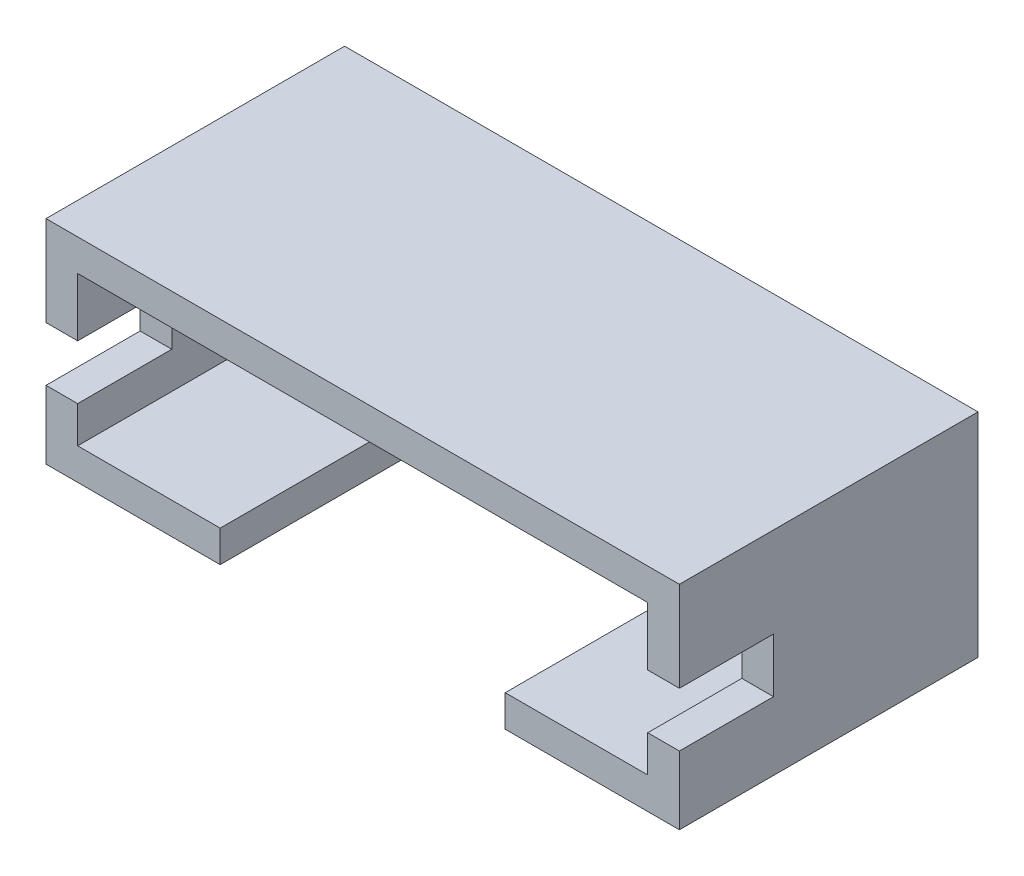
ISO-10303-21;
HEADER;
FILE_DESCRIPTION(('STEP AP214'),'2;1');
FILE_NAME('part.step','',(''),(''),'','','');
FILE_SCHEMA(('AUTOMOTIVE_DESIGN { 1 0 10303 214 1 1 1 1 }'));
ENDSEC;
DATA;
#1=APPLICATION_CONTEXT('core data for automotive mechanical design processes');
#2=APPLICATION_PROTOCOL_DEFINITION('international standard','automotive_design',2000,#1);
#3=PRODUCT_CONTEXT('',#1,'mechanical');
#4=PRODUCT('Part','Part','',(#3));
#5=PRODUCT_RELATED_PRODUCT_CATEGORY('part','',(#4));
#6=PRODUCT_DEFINITION_FORMATION('','',#4);
#7=PRODUCT_DEFINITION_CONTEXT('part definition',#1,'design');
#8=PRODUCT_DEFINITION('design','',#6,#7);
#9=PRODUCT_DEFINITION_SHAPE('','',#8);
#10=(LENGTH_UNIT() NAMED_UNIT(*) SI_UNIT(.MILLI.,.METRE.));
#11=(NAMED_UNIT(*) PLANE_ANGLE_UNIT() SI_UNIT($,.RADIAN.));
#12=(NAMED_UNIT(*) SI_UNIT($,.STERADIAN.) SOLID_ANGLE_UNIT());
#13=UNCERTAINTY_MEASURE_WITH_UNIT(LENGTH_MEASURE(1.E-05),#10,'distance_accuracy_value','');
#14=(GEOMETRIC_REPRESENTATION_CONTEXT(3) GLOBAL_UNCERTAINTY_ASSIGNED_CONTEXT((#13)) GLOBAL_UNIT_ASSIGNED_CONTEXT((#10,
#11,#12)) REPRESENTATION_CONTEXT('',''));
#15=CARTESIAN_POINT('',(0.,0.,0.));
#16=DIRECTION('',(0.,0.,1.));
#17=DIRECTION('',(1.,0.,0.));
#18=AXIS2_PLACEMENT_3D('',#15,#16,#17);
#19=CARTESIAN_POINT('',(20.2272344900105,4.7,0.));
#20=DIRECTION('',(0.,0.,-1.));
#21=DIRECTION('',(-1.,0.,0.));
#22=AXIS2_PLACEMENT_3D('',#19,#20,#21);
#23=PLANE('',#22);
#24=CARTESIAN_POINT('',(22.2351585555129,2.34999999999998,0.));
#25=DIRECTION('',(0.,0.,-1.));
#26=DIRECTION('',(-1.,0.,0.));
#27=AXIS2_PLACEMENT_3D('',#24,#25,#26);
#28=CIRCLE('',#27,0.302875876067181);
#29=CARTESIAN_POINT('',(21.9322826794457,2.34999999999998,0.));
#30=VERTEX_POINT('',#29);
#31=EDGE_CURVE('E727',#30,#30,#28,.F.);
#32=ORIENTED_EDGE('',*,*,#31,.T.);
#33=EDGE_LOOP('',(#32));
#34=FACE_BOUND('',#33,.T.);
#35=CARTESIAN_POINT('',(30.4668889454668,2.35,0.));
#36=DIRECTION('',(0.,0.,-1.));
#37=DIRECTION('',(-1.,0.,0.));
#38=AXIS2_PLACEMENT_3D('',#35,#36,#37);
#39=CIRCLE('',#38,0.302875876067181);
#40=CARTESIAN_POINT('',(30.1640130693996,2.35,0.));
#41=VERTEX_POINT('',#40);
#42=EDGE_CURVE('E744',#41,#41,#39,.F.);
#43=ORIENTED_EDGE('',*,*,#42,.T.);
#44=EDGE_LOOP('',(#43));
#45=FACE_BOUND('',#44,.T.);
#46=CARTESIAN_POINT('',(26.071966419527,2.35,0.));
#47=DIRECTION('',(0.,0.,-1.));
#48=DIRECTION('',(-1.,0.,0.));
#49=AXIS2_PLACEMENT_3D('',#46,#47,#48);
#50=CIRCLE('',#49,0.302875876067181);
#51=CARTESIAN_POINT('',(25.7690905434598,2.35,0.));
#52=VERTEX_POINT('',#51);
#53=EDGE_CURVE('E418',#52,#52,#50,.F.);
#54=ORIENTED_EDGE('',*,*,#53,.T.);
#55=EDGE_LOOP('',(#54));
#56=FACE_BOUND('',#55,.T.);
#57=DIRECTION('',(0.,-1.,0.));
#58=VECTOR('',#57,1.);
#59=CARTESIAN_POINT('',(20.2272344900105,0.,0.));
#60=LINE('',#59,#58);
#61=CARTESIAN_POINT('',(20.2272344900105,4.7,0.));
#62=VERTEX_POINT('',#61);
#63=CARTESIAN_POINT('',(20.2272344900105,0.,0.));
#64=VERTEX_POINT('',#63);
#65=EDGE_CURVE('E350',#62,#64,#60,.T.);
#66=ORIENTED_EDGE('',*,*,#65,.F.);
#67=DIRECTION('',(-1.,0.,0.));
#68=VECTOR('',#67,1.);
#69=CARTESIAN_POINT('',(20.2272344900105,4.7,0.));
#70=LINE('',#69,#68);
#71=CARTESIAN_POINT('',(34.2272344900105,4.7,0.));
#72=VERTEX_POINT('',#71);
#73=EDGE_CURVE('E383',#72,#62,#70,.T.);
#74=ORIENTED_EDGE('',*,*,#73,.F.);
#75=DIRECTION('',(0.,1.,0.));
#76=VECTOR('',#75,1.);
#77=CARTESIAN_POINT('',(34.2272344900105,0.,0.));
#78=LINE('',#77,#76);
#79=CARTESIAN_POINT('',(34.2272344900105,0.,0.));
#80=VERTEX_POINT('',#79);
#81=EDGE_CURVE('E382',#80,#72,#78,.T.);
#82=ORIENTED_EDGE('',*,*,#81,.F.);
#83=DIRECTION('',(1.,0.,0.));
#84=VECTOR('',#83,1.);
#85=CARTESIAN_POINT('',(20.2272344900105,0.,0.));
#86=LINE('',#85,#84);
#87=EDGE_CURVE('E380',#64,#80,#86,.T.);
#88=ORIENTED_EDGE('',*,*,#87,.F.);
#89=EDGE_LOOP('',(#66,#74,#82,#88));
#90=FACE_BOUND('',#89,.T.);
#91=CARTESIAN_POINT('',(28.2694276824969,2.35,0.));
#92=DIRECTION('',(0.,0.,-1.));
#93=DIRECTION('',(-1.,0.,0.));
#94=AXIS2_PLACEMENT_3D('',#91,#92,#93);
#95=CIRCLE('',#94,0.302875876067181);
#96=CARTESIAN_POINT('',(27.9665518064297,2.35,0.));
#97=VERTEX_POINT('',#96);
#98=EDGE_CURVE('E753',#97,#97,#95,.F.);
#99=ORIENTED_EDGE('',*,*,#98,.T.);
#100=EDGE_LOOP('',(#99));
#101=FACE_BOUND('',#100,.T.);
#102=CARTESIAN_POINT('',(24.269361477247,2.35,0.));
#103=DIRECTION('',(0.,0.,-1.));
#104=DIRECTION('',(-1.,0.,0.));
#105=AXIS2_PLACEMENT_3D('',#102,#103,#104);
#106=CIRCLE('',#105,0.302875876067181);
#107=CARTESIAN_POINT('',(23.9664856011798,2.35,0.));
#108=VERTEX_POINT('',#107);
#109=EDGE_CURVE('E735',#108,#108,#106,.F.);
#110=ORIENTED_EDGE('',*,*,#109,.T.);
#111=EDGE_LOOP('',(#110));
#112=FACE_BOUND('',#111,.T.);
#113=CARTESIAN_POINT('',(32.2351585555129,2.35,0.));
#114=DIRECTION('',(0.,0.,-1.));
#115=DIRECTION('',(-1.,0.,0.));
#116=AXIS2_PLACEMENT_3D('',#113,#114,#115);
#117=CIRCLE('',#116,0.302875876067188);
#118=CARTESIAN_POINT('',(31.9322826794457,2.35,0.));
#119=VERTEX_POINT('',#118);
#120=EDGE_CURVE('E716',#119,#119,#117,.F.);
#121=ORIENTED_EDGE('',*,*,#120,.T.);
#122=EDGE_LOOP('',(#121));
#123=FACE_BOUND('',#122,.T.);
#124=ADVANCED_FACE('F31',(#34,#45,#56,#90,#101,#112,#123),#23,.T.);
#125=CARTESIAN_POINT('',(20.2272344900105,4.7,0.7));
#126=DIRECTION('',(0.,0.,-1.));
#127=DIRECTION('',(-1.,0.,0.));
#128=AXIS2_PLACEMENT_3D('',#125,#126,#127);
#129=PLANE('',#128);
#130=CARTESIAN_POINT('',(22.2351585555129,2.34999999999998,0.7));
#131=DIRECTION('',(0.,0.,-1.));
#132=DIRECTION('',(-1.,0.,0.));
#133=AXIS2_PLACEMENT_3D('',#130,#131,#132);
#134=CIRCLE('',#133,0.302875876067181);
#135=CARTESIAN_POINT('',(21.9322826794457,2.34999999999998,0.7));
#136=VERTEX_POINT('',#135);
#137=EDGE_CURVE('E39',#136,#136,#134,.F.);
#138=ORIENTED_EDGE('',*,*,#137,.F.);
#139=EDGE_LOOP('',(#138));
#140=FACE_BOUND('',#139,.T.);
#141=CARTESIAN_POINT('',(30.4668889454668,2.35,0.7));
#142=DIRECTION('',(0.,0.,-1.));
#143=DIRECTION('',(-1.,0.,0.));
#144=AXIS2_PLACEMENT_3D('',#141,#142,#143);
#145=CIRCLE('',#144,0.302875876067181);
#146=CARTESIAN_POINT('',(30.1640130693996,2.35,0.7));
#147=VERTEX_POINT('',#146);
#148=EDGE_CURVE('E231',#147,#147,#145,.F.);
#149=ORIENTED_EDGE('',*,*,#148,.F.);
#150=EDGE_LOOP('',(#149));
#151=FACE_BOUND('',#150,.T.);
#152=CARTESIAN_POINT('',(26.071966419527,2.35,0.7));
#153=DIRECTION('',(0.,0.,-1.));
#154=DIRECTION('',(-1.,0.,0.));
#155=AXIS2_PLACEMENT_3D('',#152,#153,#154);
#156=CIRCLE('',#155,0.302875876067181);
#157=CARTESIAN_POINT('',(25.7690905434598,2.35,0.7));
#158=VERTEX_POINT('',#157);
#159=EDGE_CURVE('E225',#158,#158,#156,.F.);
#160=ORIENTED_EDGE('',*,*,#159,.F.);
#161=EDGE_LOOP('',(#160));
#162=FACE_BOUND('',#161,.T.);
#163=DIRECTION('',(0.,-1.,0.));
#164=VECTOR('',#163,1.);
#165=CARTESIAN_POINT('',(20.9272344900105,4.7,0.7));
#166=LINE('',#165,#164);
#167=CARTESIAN_POINT('',(20.9272344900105,4.,0.7));
#168=VERTEX_POINT('',#167);
#169=CARTESIAN_POINT('',(20.9272344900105,0.699999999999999,0.7));
#170=VERTEX_POINT('',#169);
#171=EDGE_CURVE('E252',#168,#170,#166,.T.);
#172=ORIENTED_EDGE('',*,*,#171,.T.);
#173=DIRECTION('',(1.,0.,0.));
#174=VECTOR('',#173,1.);
#175=CARTESIAN_POINT('',(20.2272344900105,0.699999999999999,0.7));
#176=LINE('',#175,#174);
#177=CARTESIAN_POINT('',(33.5272344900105,0.7,0.7));
#178=VERTEX_POINT('',#177);
#179=EDGE_CURVE('E346',#170,#178,#176,.T.);
#180=ORIENTED_EDGE('',*,*,#179,.T.);
#181=DIRECTION('',(0.,1.,0.));
#182=VECTOR('',#181,1.);
#183=CARTESIAN_POINT('',(33.5272344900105,4.7,0.7));
#184=LINE('',#183,#182);
#185=CARTESIAN_POINT('',(33.5272344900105,4.,0.7));
#186=VERTEX_POINT('',#185);
#187=EDGE_CURVE('E358',#178,#186,#184,.T.);
#188=ORIENTED_EDGE('',*,*,#187,.T.);
#189=DIRECTION('',(-1.,0.,0.));
#190=VECTOR('',#189,1.);
#191=CARTESIAN_POINT('',(20.2272344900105,4.,0.7));
#192=LINE('',#191,#190);
#193=EDGE_CURVE('E362',#186,#168,#192,.T.);
#194=ORIENTED_EDGE('',*,*,#193,.T.);
#195=EDGE_LOOP('',(#172,#180,#188,#194));
#196=FACE_BOUND('',#195,.T.);
#197=CARTESIAN_POINT('',(28.2694276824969,2.35,0.7));
#198=DIRECTION('',(0.,0.,-1.));
#199=DIRECTION('',(-1.,0.,0.));
#200=AXIS2_PLACEMENT_3D('',#197,#198,#199);
#201=CIRCLE('',#200,0.302875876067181);
#202=CARTESIAN_POINT('',(27.9665518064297,2.35,0.7));
#203=VERTEX_POINT('',#202);
#204=EDGE_CURVE('E228',#203,#203,#201,.F.);
#205=ORIENTED_EDGE('',*,*,#204,.F.);
#206=EDGE_LOOP('',(#205));
#207=FACE_BOUND('',#206,.T.);
#208=CARTESIAN_POINT('',(24.269361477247,2.35,0.7));
#209=DIRECTION('',(0.,0.,-1.));
#210=DIRECTION('',(-1.,0.,0.));
#211=AXIS2_PLACEMENT_3D('',#208,#209,#210);
#212=CIRCLE('',#211,0.302875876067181);
#213=CARTESIAN_POINT('',(23.9664856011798,2.35,0.7));
#214=VERTEX_POINT('',#213);
#215=EDGE_CURVE('E234',#214,#214,#212,.F.);
#216=ORIENTED_EDGE('',*,*,#215,.F.);
#217=EDGE_LOOP('',(#216));
#218=FACE_BOUND('',#217,.T.);
#219=CARTESIAN_POINT('',(32.2351585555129,2.35,0.7));
#220=DIRECTION('',(0.,0.,-1.));
#221=DIRECTION('',(-1.,0.,0.));
#222=AXIS2_PLACEMENT_3D('',#219,#220,#221);
#223=CIRCLE('',#222,0.302875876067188);
#224=CARTESIAN_POINT('',(31.9322826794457,2.35,0.7));
#225=VERTEX_POINT('',#224);
#226=EDGE_CURVE('E11',#225,#225,#223,.F.);
#227=ORIENTED_EDGE('',*,*,#226,.F.);
#228=EDGE_LOOP('',(#227));
#229=FACE_BOUND('',#228,.T.);
#230=ADVANCED_FACE('F241',(#140,#151,#162,#196,#207,#218,#229),#129,.F.);
#231=CARTESIAN_POINT('',(20.2272344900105,4.7,6.6));
#232=DIRECTION('',(0.,0.,-1.));
#233=DIRECTION('',(-1.,0.,0.));
#234=AXIS2_PLACEMENT_3D('',#231,#232,#233);
#235=PLANE('',#234);
#236=DIRECTION('',(1.,0.,0.));
#237=VECTOR('',#236,1.);
#238=CARTESIAN_POINT('',(20.2272344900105,0.,6.6));
#239=LINE('',#238,#237);
#240=CARTESIAN_POINT('',(20.2272344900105,0.,6.6));
#241=VERTEX_POINT('',#240);
#242=CARTESIAN_POINT('',(24.0772344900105,0.,6.6));
#243=VERTEX_POINT('',#242);
#244=EDGE_CURVE('E187',#241,#243,#239,.T.);
#245=ORIENTED_EDGE('',*,*,#244,.T.);
#246=DIRECTION('',(0.,-1.,0.));
#247=VECTOR('',#246,1.);
#248=CARTESIAN_POINT('',(24.0772344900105,4.701,6.6));
#249=LINE('',#248,#247);
#250=CARTESIAN_POINT('',(24.0772344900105,0.699999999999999,6.6));
#251=VERTEX_POINT('',#250);
#252=EDGE_CURVE('E168',#251,#243,#249,.T.);
#253=ORIENTED_EDGE('',*,*,#252,.F.);
#254=DIRECTION('',(1.,0.,0.));
#255=VECTOR('',#254,1.);
#256=CARTESIAN_POINT('',(20.2272344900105,0.699999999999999,6.6));
#257=LINE('',#256,#255);
#258=CARTESIAN_POINT('',(20.9272344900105,0.699999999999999,6.6));
#259=VERTEX_POINT('',#258);
#260=EDGE_CURVE('E371',#259,#251,#257,.T.);
#261=ORIENTED_EDGE('',*,*,#260,.F.);
#262=DIRECTION('',(0.,-1.,0.));
#263=VECTOR('',#262,1.);
#264=CARTESIAN_POINT('',(20.9272344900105,4.7,6.6));
#265=LINE('',#264,#263);
#266=CARTESIAN_POINT('',(20.9272344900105,1.50856992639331,6.6));
#267=VERTEX_POINT('',#266);
#268=EDGE_CURVE('E366',#267,#259,#265,.T.);
#269=ORIENTED_EDGE('',*,*,#268,.F.);
#270=DIRECTION('',(1.,0.,0.));
#271=VECTOR('',#270,1.);
#272=CARTESIAN_POINT('',(20.2272344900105,1.50856992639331,6.6));
#273=LINE('',#272,#271);
#274=CARTESIAN_POINT('',(20.2272344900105,1.50856992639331,6.6));
#275=VERTEX_POINT('',#274);
#276=EDGE_CURVE('E54',#275,#267,#273,.T.);
#277=ORIENTED_EDGE('',*,*,#276,.F.);
#278=DIRECTION('',(0.,-1.,0.));
#279=VECTOR('',#278,1.);
#280=CARTESIAN_POINT('',(20.2272344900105,0.,6.6));
#281=LINE('',#280,#279);
#282=EDGE_CURVE('E194',#275,#241,#281,.T.);
#283=ORIENTED_EDGE('',*,*,#282,.T.);
#284=EDGE_LOOP('',(#245,#253,#261,#269,#277,#283));
#285=FACE_BOUND('',#284,.T.);
#286=ADVANCED_FACE('F192',(#285),#235,.F.);
#287=CARTESIAN_POINT('',(20.2272344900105,4.7,6.6));
#288=VERTEX_POINT('',#287);
#289=CARTESIAN_POINT('',(20.2272344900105,2.70856992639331,6.6));
#290=VERTEX_POINT('',#289);
#291=EDGE_CURVE('E200',#288,#290,#281,.T.);
#292=ORIENTED_EDGE('',*,*,#291,.T.);
#293=DIRECTION('',(1.,0.,0.));
#294=VECTOR('',#293,1.);
#295=CARTESIAN_POINT('',(20.2272344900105,2.70856992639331,6.6));
#296=LINE('',#295,#294);
#297=CARTESIAN_POINT('',(20.9272344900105,2.70856992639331,6.6));
#298=VERTEX_POINT('',#297);
#299=EDGE_CURVE('E327',#290,#298,#296,.T.);
#300=ORIENTED_EDGE('',*,*,#299,.T.);
#301=CARTESIAN_POINT('',(20.9272344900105,4.,6.6));
#302=VERTEX_POINT('',#301);
#303=EDGE_CURVE('E367',#302,#298,#265,.T.);
#304=ORIENTED_EDGE('',*,*,#303,.F.);
#305=DIRECTION('',(-1.,0.,0.));
#306=VECTOR('',#305,1.);
#307=CARTESIAN_POINT('',(20.2272344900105,4.,6.6));
#308=LINE('',#307,#306);
#309=CARTESIAN_POINT('',(33.5272344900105,4.,6.6));
#310=VERTEX_POINT('',#309);
#311=EDGE_CURVE('E356',#310,#302,#308,.T.);
#312=ORIENTED_EDGE('',*,*,#311,.F.);
#313=DIRECTION('',(0.,1.,0.));
#314=VECTOR('',#313,1.);
#315=CARTESIAN_POINT('',(33.5272344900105,4.7,6.6));
#316=LINE('',#315,#314);
#317=CARTESIAN_POINT('',(33.5272344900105,2.70856992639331,6.6));
#318=VERTEX_POINT('',#317);
#319=EDGE_CURVE('E373',#318,#310,#316,.T.);
#320=ORIENTED_EDGE('',*,*,#319,.F.);
#321=CARTESIAN_POINT('',(34.2272344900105,2.70856992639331,6.6));
#322=VERTEX_POINT('',#321);
#323=EDGE_CURVE('E331',#318,#322,#296,.T.);
#324=ORIENTED_EDGE('',*,*,#323,.T.);
#325=DIRECTION('',(0.,1.,0.));
#326=VECTOR('',#325,1.);
#327=CARTESIAN_POINT('',(34.2272344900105,0.,6.6));
#328=LINE('',#327,#326);
#329=CARTESIAN_POINT('',(34.2272344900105,4.7,6.6));
#330=VERTEX_POINT('',#329);
#331=EDGE_CURVE('E195',#322,#330,#328,.T.);
#332=ORIENTED_EDGE('',*,*,#331,.T.);
#333=DIRECTION('',(-1.,0.,0.));
#334=VECTOR('',#333,1.);
#335=CARTESIAN_POINT('',(20.2272344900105,4.7,6.6));
#336=LINE('',#335,#334);
#337=EDGE_CURVE('E205',#330,#288,#336,.T.);
#338=ORIENTED_EDGE('',*,*,#337,.T.);
#339=EDGE_LOOP('',(#292,#300,#304,#312,#320,#324,#332,#338));
#340=FACE_BOUND('',#339,.T.);
#341=ADVANCED_FACE('F289',(#340),#235,.F.);
#342=CARTESIAN_POINT('',(30.3772344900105,0.7,6.6));
#343=VERTEX_POINT('',#342);
#344=CARTESIAN_POINT('',(33.5272344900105,0.7,6.6));
#345=VERTEX_POINT('',#344);
#346=EDGE_CURVE('E370',#343,#345,#257,.T.);
#347=ORIENTED_EDGE('',*,*,#346,.F.);
#348=DIRECTION('',(0.,-1.,0.));
#349=VECTOR('',#348,1.);
#350=CARTESIAN_POINT('',(30.3772344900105,4.701,6.6));
#351=LINE('',#350,#349);
#352=CARTESIAN_POINT('',(30.3772344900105,0.,6.6));
#353=VERTEX_POINT('',#352);
#354=EDGE_CURVE('E406',#343,#353,#351,.T.);
#355=ORIENTED_EDGE('',*,*,#354,.T.);
#356=CARTESIAN_POINT('',(34.2272344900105,0.,6.6));
#357=VERTEX_POINT('',#356);
#358=EDGE_CURVE('E196',#353,#357,#239,.T.);
#359=ORIENTED_EDGE('',*,*,#358,.T.);
#360=CARTESIAN_POINT('',(34.2272344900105,1.50856992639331,6.6));
#361=VERTEX_POINT('',#360);
#362=EDGE_CURVE('E198',#357,#361,#328,.T.);
#363=ORIENTED_EDGE('',*,*,#362,.T.);
#364=CARTESIAN_POINT('',(33.5272344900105,1.50856992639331,6.6));
#365=VERTEX_POINT('',#364);
#366=EDGE_CURVE('E321',#365,#361,#273,.T.);
#367=ORIENTED_EDGE('',*,*,#366,.F.);
#368=EDGE_CURVE('E374',#345,#365,#316,.T.);
#369=ORIENTED_EDGE('',*,*,#368,.F.);
#370=EDGE_LOOP('',(#347,#355,#359,#363,#367,#369));
#371=FACE_BOUND('',#370,.T.);
#372=ADVANCED_FACE('F286',(#371),#235,.F.);
#373=CARTESIAN_POINT('',(20.2272344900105,0.,6.6));
#374=DIRECTION('',(1.,0.,0.));
#375=DIRECTION('',(0.,0.,-1.));
#376=AXIS2_PLACEMENT_3D('',#373,#374,#375);
#377=PLANE('',#376);
#378=DIRECTION('',(0.,1.,0.));
#379=VECTOR('',#378,1.);
#380=CARTESIAN_POINT('',(20.2272344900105,1.50856992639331,4.52038481));
#381=LINE('',#380,#379);
#382=CARTESIAN_POINT('',(20.2272344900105,1.50856992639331,4.52038481));
#383=VERTEX_POINT('',#382);
#384=CARTESIAN_POINT('',(20.2272344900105,2.70856992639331,4.52038481));
#385=VERTEX_POINT('',#384);
#386=EDGE_CURVE('E312',#383,#385,#381,.T.);
#387=ORIENTED_EDGE('',*,*,#386,.T.);
#388=DIRECTION('',(0.,0.,1.));
#389=VECTOR('',#388,1.);
#390=CARTESIAN_POINT('',(20.2272344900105,2.70856992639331,6.6));
#391=LINE('',#390,#389);
#392=EDGE_CURVE('E315',#385,#290,#391,.T.);
#393=ORIENTED_EDGE('',*,*,#392,.T.);
#394=ORIENTED_EDGE('',*,*,#291,.F.);
#395=DIRECTION('',(0.,0.,-1.));
#396=VECTOR('',#395,1.);
#397=CARTESIAN_POINT('',(20.2272344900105,4.7,6.6));
#398=LINE('',#397,#396);
#399=EDGE_CURVE('E207',#288,#62,#398,.T.);
#400=ORIENTED_EDGE('',*,*,#399,.T.);
#401=ORIENTED_EDGE('',*,*,#65,.T.);
#402=DIRECTION('',(0.,0.,-1.));
#403=VECTOR('',#402,1.);
#404=CARTESIAN_POINT('',(20.2272344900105,0.,6.6));
#405=LINE('',#404,#403);
#406=EDGE_CURVE('E216',#241,#64,#405,.T.);
#407=ORIENTED_EDGE('',*,*,#406,.F.);
#408=ORIENTED_EDGE('',*,*,#282,.F.);
#409=DIRECTION('',(0.,0.,-1.));
#410=VECTOR('',#409,1.);
#411=CARTESIAN_POINT('',(20.2272344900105,1.50856992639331,6.6));
#412=LINE('',#411,#410);
#413=EDGE_CURVE('E317',#275,#383,#412,.T.);
#414=ORIENTED_EDGE('',*,*,#413,.T.);
#415=EDGE_LOOP('',(#387,#393,#394,#400,#401,#407,#408,#414));
#416=FACE_BOUND('',#415,.T.);
#417=ADVANCED_FACE('F33',(#416),#377,.F.);
#418=CARTESIAN_POINT('',(20.2272344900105,0.,6.6));
#419=DIRECTION('',(0.,1.,0.));
#420=DIRECTION('',(-1.,0.,0.));
#421=AXIS2_PLACEMENT_3D('',#418,#419,#420);
#422=PLANE('',#421);
#423=DIRECTION('',(1.,0.,0.));
#424=VECTOR('',#423,1.);
#425=CARTESIAN_POINT('',(24.0772344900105,0.,1.16189975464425));
#426=LINE('',#425,#424);
#427=CARTESIAN_POINT('',(24.0772344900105,0.,1.16189975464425));
#428=VERTEX_POINT('',#427);
#429=CARTESIAN_POINT('',(30.3772344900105,0.,1.16189975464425));
#430=VERTEX_POINT('',#429);
#431=EDGE_CURVE('E190',#428,#430,#426,.T.);
#432=ORIENTED_EDGE('',*,*,#431,.F.);
#433=DIRECTION('',(0.,0.,-1.));
#434=VECTOR('',#433,1.);
#435=CARTESIAN_POINT('',(24.0772344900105,0.,6.6));
#436=LINE('',#435,#434);
#437=EDGE_CURVE('E172',#243,#428,#436,.T.);
#438=ORIENTED_EDGE('',*,*,#437,.F.);
#439=ORIENTED_EDGE('',*,*,#244,.F.);
#440=ORIENTED_EDGE('',*,*,#406,.T.);
#441=ORIENTED_EDGE('',*,*,#87,.T.);
#442=DIRECTION('',(0.,0.,-1.));
#443=VECTOR('',#442,1.);
#444=CARTESIAN_POINT('',(34.2272344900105,0.,6.6));
#445=LINE('',#444,#443);
#446=EDGE_CURVE('E213',#357,#80,#445,.T.);
#447=ORIENTED_EDGE('',*,*,#446,.F.);
#448=ORIENTED_EDGE('',*,*,#358,.F.);
#449=DIRECTION('',(0.,0.,1.));
#450=VECTOR('',#449,1.);
#451=CARTESIAN_POINT('',(30.3772344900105,0.,6.6));
#452=LINE('',#451,#450);
#453=EDGE_CURVE('E407',#430,#353,#452,.T.);
#454=ORIENTED_EDGE('',*,*,#453,.F.);
#455=EDGE_LOOP('',(#432,#438,#439,#440,#441,#447,#448,#454));
#456=FACE_BOUND('',#455,.T.);
#457=ADVANCED_FACE('F185',(#456),#422,.F.);
#458=CARTESIAN_POINT('',(34.2272344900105,0.,6.6));
#459=DIRECTION('',(-1.,0.,0.));
#460=DIRECTION('',(0.,0.,1.));
#461=AXIS2_PLACEMENT_3D('',#458,#459,#460);
#462=PLANE('',#461);
#463=ORIENTED_EDGE('',*,*,#331,.F.);
#464=DIRECTION('',(0.,0.,1.));
#465=VECTOR('',#464,1.);
#466=CARTESIAN_POINT('',(34.2272344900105,2.70856992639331,6.6));
#467=LINE('',#466,#465);
#468=CARTESIAN_POINT('',(34.2272344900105,2.70856992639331,4.52038481));
#469=VERTEX_POINT('',#468);
#470=EDGE_CURVE('E323',#469,#322,#467,.T.);
#471=ORIENTED_EDGE('',*,*,#470,.F.);
#472=DIRECTION('',(0.,1.,0.));
#473=VECTOR('',#472,1.);
#474=CARTESIAN_POINT('',(34.2272344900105,1.50856992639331,4.52038481));
#475=LINE('',#474,#473);
#476=CARTESIAN_POINT('',(34.2272344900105,1.50856992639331,4.52038481));
#477=VERTEX_POINT('',#476);
#478=EDGE_CURVE('E410',#477,#469,#475,.T.);
#479=ORIENTED_EDGE('',*,*,#478,.F.);
#480=DIRECTION('',(0.,0.,-1.));
#481=VECTOR('',#480,1.);
#482=CARTESIAN_POINT('',(34.2272344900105,1.50856992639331,6.6));
#483=LINE('',#482,#481);
#484=EDGE_CURVE('E401',#361,#477,#483,.T.);
#485=ORIENTED_EDGE('',*,*,#484,.F.);
#486=ORIENTED_EDGE('',*,*,#362,.F.);
#487=ORIENTED_EDGE('',*,*,#446,.T.);
#488=ORIENTED_EDGE('',*,*,#81,.T.);
#489=DIRECTION('',(0.,0.,-1.));
#490=VECTOR('',#489,1.);
#491=CARTESIAN_POINT('',(34.2272344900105,4.7,6.6));
#492=LINE('',#491,#490);
#493=EDGE_CURVE('E210',#330,#72,#492,.T.);
#494=ORIENTED_EDGE('',*,*,#493,.F.);
#495=EDGE_LOOP('',(#463,#471,#479,#485,#486,#487,#488,#494));
#496=FACE_BOUND('',#495,.T.);
#497=ADVANCED_FACE('F295',(#496),#462,.F.);
#498=CARTESIAN_POINT('',(20.2272344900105,4.7,6.6));
#499=DIRECTION('',(0.,-1.,0.));
#500=DIRECTION('',(0.,0.,-1.));
#501=AXIS2_PLACEMENT_3D('',#498,#499,#500);
#502=PLANE('',#501);
#503=ORIENTED_EDGE('',*,*,#73,.T.);
#504=ORIENTED_EDGE('',*,*,#399,.F.);
#505=ORIENTED_EDGE('',*,*,#337,.F.);
#506=ORIENTED_EDGE('',*,*,#493,.T.);
#507=EDGE_LOOP('',(#503,#504,#505,#506));
#508=FACE_BOUND('',#507,.T.);
#509=ADVANCED_FACE('F291',(#508),#502,.F.);
#510=CARTESIAN_POINT('',(20.9272344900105,0.,6.6));
#511=DIRECTION('',(1.,0.,0.));
#512=DIRECTION('',(0.,0.,-1.));
#513=AXIS2_PLACEMENT_3D('',#510,#511,#512);
#514=PLANE('',#513);
#515=DIRECTION('',(0.,0.,1.));
#516=VECTOR('',#515,1.);
#517=CARTESIAN_POINT('',(20.9272344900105,2.70856992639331,6.6));
#518=LINE('',#517,#516);
#519=CARTESIAN_POINT('',(20.9272344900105,2.70856992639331,4.52038481));
#520=VERTEX_POINT('',#519);
#521=EDGE_CURVE('E343',#520,#298,#518,.T.);
#522=ORIENTED_EDGE('',*,*,#521,.F.);
#523=DIRECTION('',(0.,1.,0.));
#524=VECTOR('',#523,1.);
#525=CARTESIAN_POINT('',(20.9272344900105,0.,4.52038481));
#526=LINE('',#525,#524);
#527=CARTESIAN_POINT('',(20.9272344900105,1.50856992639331,4.52038481));
#528=VERTEX_POINT('',#527);
#529=EDGE_CURVE('E341',#528,#520,#526,.T.);
#530=ORIENTED_EDGE('',*,*,#529,.F.);
#531=DIRECTION('',(0.,0.,-1.));
#532=VECTOR('',#531,1.);
#533=CARTESIAN_POINT('',(20.9272344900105,1.50856992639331,6.6));
#534=LINE('',#533,#532);
#535=EDGE_CURVE('E330',#267,#528,#534,.T.);
#536=ORIENTED_EDGE('',*,*,#535,.F.);
#537=ORIENTED_EDGE('',*,*,#268,.T.);
#538=DIRECTION('',(0.,0.,-1.));
#539=VECTOR('',#538,1.);
#540=CARTESIAN_POINT('',(20.9272344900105,0.699999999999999,6.6));
#541=LINE('',#540,#539);
#542=EDGE_CURVE('E347',#259,#170,#541,.T.);
#543=ORIENTED_EDGE('',*,*,#542,.T.);
#544=ORIENTED_EDGE('',*,*,#171,.F.);
#545=DIRECTION('',(0.,0.,-1.));
#546=VECTOR('',#545,1.);
#547=CARTESIAN_POINT('',(20.9272344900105,4.,6.6));
#548=LINE('',#547,#546);
#549=EDGE_CURVE('E352',#302,#168,#548,.T.);
#550=ORIENTED_EDGE('',*,*,#549,.F.);
#551=ORIENTED_EDGE('',*,*,#303,.T.);
#552=EDGE_LOOP('',(#522,#530,#536,#537,#543,#544,#550,#551));
#553=FACE_BOUND('',#552,.T.);
#554=ADVANCED_FACE('F294',(#553),#514,.T.);
#555=CARTESIAN_POINT('',(20.2272344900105,0.699999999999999,6.6));
#556=DIRECTION('',(0.,1.,0.));
#557=DIRECTION('',(-1.,0.,0.));
#558=AXIS2_PLACEMENT_3D('',#555,#556,#557);
#559=PLANE('',#558);
#560=DIRECTION('',(0.,0.,-1.));
#561=VECTOR('',#560,1.);
#562=CARTESIAN_POINT('',(24.0772344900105,0.699999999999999,6.6));
#563=LINE('',#562,#561);
#564=CARTESIAN_POINT('',(24.0772344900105,0.699999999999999,1.16189975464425));
#565=VERTEX_POINT('',#564);
#566=EDGE_CURVE('E175',#251,#565,#563,.T.);
#567=ORIENTED_EDGE('',*,*,#566,.T.);
#568=DIRECTION('',(1.,0.,0.));
#569=VECTOR('',#568,1.);
#570=CARTESIAN_POINT('',(24.0772344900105,0.699999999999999,1.16189975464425));
#571=LINE('',#570,#569);
#572=CARTESIAN_POINT('',(30.3772344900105,0.7,1.16189975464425));
#573=VERTEX_POINT('',#572);
#574=EDGE_CURVE('E414',#565,#573,#571,.T.);
#575=ORIENTED_EDGE('',*,*,#574,.T.);
#576=DIRECTION('',(0.,0.,1.));
#577=VECTOR('',#576,1.);
#578=CARTESIAN_POINT('',(30.3772344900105,0.7,6.6));
#579=LINE('',#578,#577);
#580=EDGE_CURVE('E180',#573,#343,#579,.T.);
#581=ORIENTED_EDGE('',*,*,#580,.T.);
#582=ORIENTED_EDGE('',*,*,#346,.T.);
#583=DIRECTION('',(0.,0.,-1.));
#584=VECTOR('',#583,1.);
#585=CARTESIAN_POINT('',(33.5272344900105,0.7,6.6));
#586=LINE('',#585,#584);
#587=EDGE_CURVE('E351',#345,#178,#586,.T.);
#588=ORIENTED_EDGE('',*,*,#587,.T.);
#589=ORIENTED_EDGE('',*,*,#179,.F.);
#590=ORIENTED_EDGE('',*,*,#542,.F.);
#591=ORIENTED_EDGE('',*,*,#260,.T.);
#592=EDGE_LOOP('',(#567,#575,#581,#582,#588,#589,#590,#591));
#593=FACE_BOUND('',#592,.T.);
#594=ADVANCED_FACE('F445',(#593),#559,.T.);
#595=CARTESIAN_POINT('',(33.5272344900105,0.,6.6));
#596=DIRECTION('',(-1.,0.,0.));
#597=DIRECTION('',(0.,0.,1.));
#598=AXIS2_PLACEMENT_3D('',#595,#596,#597);
#599=PLANE('',#598);
#600=DIRECTION('',(0.,0.,-1.));
#601=VECTOR('',#600,1.);
#602=CARTESIAN_POINT('',(33.5272344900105,2.70856992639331,6.6));
#603=LINE('',#602,#601);
#604=CARTESIAN_POINT('',(33.5272344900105,2.70856992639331,4.52038481));
#605=VERTEX_POINT('',#604);
#606=EDGE_CURVE('E223',#318,#605,#603,.T.);
#607=ORIENTED_EDGE('',*,*,#606,.F.);
#608=ORIENTED_EDGE('',*,*,#319,.T.);
#609=DIRECTION('',(0.,0.,-1.));
#610=VECTOR('',#609,1.);
#611=CARTESIAN_POINT('',(33.5272344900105,4.,6.6));
#612=LINE('',#611,#610);
#613=EDGE_CURVE('E355',#310,#186,#612,.T.);
#614=ORIENTED_EDGE('',*,*,#613,.T.);
#615=ORIENTED_EDGE('',*,*,#187,.F.);
#616=ORIENTED_EDGE('',*,*,#587,.F.);
#617=ORIENTED_EDGE('',*,*,#368,.T.);
#618=DIRECTION('',(0.,0.,1.));
#619=VECTOR('',#618,1.);
#620=CARTESIAN_POINT('',(33.5272344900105,1.50856992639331,6.6));
#621=LINE('',#620,#619);
#622=CARTESIAN_POINT('',(33.5272344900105,1.50856992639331,4.52038481));
#623=VERTEX_POINT('',#622);
#624=EDGE_CURVE('E218',#623,#365,#621,.T.);
#625=ORIENTED_EDGE('',*,*,#624,.F.);
#626=DIRECTION('',(0.,-1.,0.));
#627=VECTOR('',#626,1.);
#628=CARTESIAN_POINT('',(33.5272344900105,0.,4.52038481));
#629=LINE('',#628,#627);
#630=EDGE_CURVE('E220',#605,#623,#629,.T.);
#631=ORIENTED_EDGE('',*,*,#630,.F.);
#632=EDGE_LOOP('',(#607,#608,#614,#615,#616,#617,#625,#631));
#633=FACE_BOUND('',#632,.T.);
#634=ADVANCED_FACE('F435',(#633),#599,.T.);
#635=CARTESIAN_POINT('',(20.2272344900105,4.,6.6));
#636=DIRECTION('',(0.,-1.,0.));
#637=DIRECTION('',(0.,0.,-1.));
#638=AXIS2_PLACEMENT_3D('',#635,#636,#637);
#639=PLANE('',#638);
#640=ORIENTED_EDGE('',*,*,#193,.F.);
#641=ORIENTED_EDGE('',*,*,#613,.F.);
#642=ORIENTED_EDGE('',*,*,#311,.T.);
#643=ORIENTED_EDGE('',*,*,#549,.T.);
#644=EDGE_LOOP('',(#640,#641,#642,#643));
#645=FACE_BOUND('',#644,.T.);
#646=ADVANCED_FACE('F440',(#645),#639,.T.);
#647=CARTESIAN_POINT('',(20.2272344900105,1.50856992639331,6.6));
#648=DIRECTION('',(0.,-1.,0.));
#649=DIRECTION('',(0.,0.,-1.));
#650=AXIS2_PLACEMENT_3D('',#647,#648,#649);
#651=PLANE('',#650);
#652=ORIENTED_EDGE('',*,*,#624,.T.);
#653=ORIENTED_EDGE('',*,*,#366,.T.);
#654=ORIENTED_EDGE('',*,*,#484,.T.);
#655=DIRECTION('',(1.,0.,0.));
#656=VECTOR('',#655,1.);
#657=CARTESIAN_POINT('',(20.2272344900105,1.50856992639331,4.52038481));
#658=LINE('',#657,#656);
#659=EDGE_CURVE('E338',#623,#477,#658,.T.);
#660=ORIENTED_EDGE('',*,*,#659,.F.);
#661=EDGE_LOOP('',(#652,#653,#654,#660));
#662=FACE_BOUND('',#661,.T.);
#663=ADVANCED_FACE('F470',(#662),#651,.F.);
#664=CARTESIAN_POINT('',(20.2272344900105,1.50856992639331,4.52038481));
#665=DIRECTION('',(0.,0.,-1.));
#666=DIRECTION('',(-1.,0.,0.));
#667=AXIS2_PLACEMENT_3D('',#664,#665,#666);
#668=PLANE('',#667);
#669=ORIENTED_EDGE('',*,*,#630,.T.);
#670=ORIENTED_EDGE('',*,*,#659,.T.);
#671=ORIENTED_EDGE('',*,*,#478,.T.);
#672=DIRECTION('',(1.,0.,0.));
#673=VECTOR('',#672,1.);
#674=CARTESIAN_POINT('',(20.2272344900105,2.70856992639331,4.52038481));
#675=LINE('',#674,#673);
#676=EDGE_CURVE('E335',#605,#469,#675,.T.);
#677=ORIENTED_EDGE('',*,*,#676,.F.);
#678=EDGE_LOOP('',(#669,#670,#671,#677));
#679=FACE_BOUND('',#678,.T.);
#680=ADVANCED_FACE('F465',(#679),#668,.F.);
#681=CARTESIAN_POINT('',(20.2272344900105,2.70856992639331,6.6));
#682=DIRECTION('',(0.,1.,0.));
#683=DIRECTION('',(0.,0.,1.));
#684=AXIS2_PLACEMENT_3D('',#681,#682,#683);
#685=PLANE('',#684);
#686=ORIENTED_EDGE('',*,*,#606,.T.);
#687=ORIENTED_EDGE('',*,*,#676,.T.);
#688=ORIENTED_EDGE('',*,*,#470,.T.);
#689=ORIENTED_EDGE('',*,*,#323,.F.);
#690=EDGE_LOOP('',(#686,#687,#688,#689));
#691=FACE_BOUND('',#690,.T.);
#692=ADVANCED_FACE('F428',(#691),#685,.F.);
#693=ORIENTED_EDGE('',*,*,#521,.T.);
#694=ORIENTED_EDGE('',*,*,#299,.F.);
#695=ORIENTED_EDGE('',*,*,#392,.F.);
#696=EDGE_CURVE('E332',#385,#520,#675,.T.);
#697=ORIENTED_EDGE('',*,*,#696,.T.);
#698=EDGE_LOOP('',(#693,#694,#695,#697));
#699=FACE_BOUND('',#698,.T.);
#700=ADVANCED_FACE('F457',(#699),#685,.F.);
#701=ORIENTED_EDGE('',*,*,#529,.T.);
#702=ORIENTED_EDGE('',*,*,#696,.F.);
#703=ORIENTED_EDGE('',*,*,#386,.F.);
#704=EDGE_CURVE('E336',#383,#528,#658,.T.);
#705=ORIENTED_EDGE('',*,*,#704,.T.);
#706=EDGE_LOOP('',(#701,#702,#703,#705));
#707=FACE_BOUND('',#706,.T.);
#708=ADVANCED_FACE('F455',(#707),#668,.F.);
#709=ORIENTED_EDGE('',*,*,#535,.T.);
#710=ORIENTED_EDGE('',*,*,#704,.F.);
#711=ORIENTED_EDGE('',*,*,#413,.F.);
#712=ORIENTED_EDGE('',*,*,#276,.T.);
#713=EDGE_LOOP('',(#709,#710,#711,#712));
#714=FACE_BOUND('',#713,.T.);
#715=ADVANCED_FACE('F454',(#714),#651,.F.);
#716=CARTESIAN_POINT('',(24.0772344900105,4.701,6.6));
#717=DIRECTION('',(-1.,0.,0.));
#718=DIRECTION('',(0.,-1.,0.));
#719=AXIS2_PLACEMENT_3D('',#716,#717,#718);
#720=PLANE('',#719);
#721=ORIENTED_EDGE('',*,*,#252,.T.);
#722=ORIENTED_EDGE('',*,*,#437,.T.);
#723=DIRECTION('',(0.,-1.,0.));
#724=VECTOR('',#723,1.);
#725=CARTESIAN_POINT('',(24.0772344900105,4.701,1.16189975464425));
#726=LINE('',#725,#724);
#727=EDGE_CURVE('E181',#565,#428,#726,.T.);
#728=ORIENTED_EDGE('',*,*,#727,.F.);
#729=ORIENTED_EDGE('',*,*,#566,.F.);
#730=EDGE_LOOP('',(#721,#722,#728,#729));
#731=FACE_BOUND('',#730,.T.);
#732=ADVANCED_FACE('F170',(#731),#720,.F.);
#733=CARTESIAN_POINT('',(30.3772344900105,4.701,6.6));
#734=DIRECTION('',(1.,0.,0.));
#735=DIRECTION('',(0.,1.,0.));
#736=AXIS2_PLACEMENT_3D('',#733,#734,#735);
#737=PLANE('',#736);
#738=DIRECTION('',(0.,-1.,0.));
#739=VECTOR('',#738,1.);
#740=CARTESIAN_POINT('',(30.3772344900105,4.701,1.16189975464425));
#741=LINE('',#740,#739);
#742=EDGE_CURVE('E46',#573,#430,#741,.T.);
#743=ORIENTED_EDGE('',*,*,#742,.T.);
#744=ORIENTED_EDGE('',*,*,#453,.T.);
#745=ORIENTED_EDGE('',*,*,#354,.F.);
#746=ORIENTED_EDGE('',*,*,#580,.F.);
#747=EDGE_LOOP('',(#743,#744,#745,#746));
#748=FACE_BOUND('',#747,.T.);
#749=ADVANCED_FACE('F447',(#748),#737,.F.);
#750=CARTESIAN_POINT('',(24.0772344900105,4.701,1.16189975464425));
#751=DIRECTION('',(0.,0.,-1.));
#752=DIRECTION('',(-1.,0.,0.));
#753=AXIS2_PLACEMENT_3D('',#750,#751,#752);
#754=PLANE('',#753);
#755=ORIENTED_EDGE('',*,*,#727,.T.);
#756=ORIENTED_EDGE('',*,*,#431,.T.);
#757=ORIENTED_EDGE('',*,*,#742,.F.);
#758=ORIENTED_EDGE('',*,*,#574,.F.);
#759=EDGE_LOOP('',(#755,#756,#757,#758));
#760=FACE_BOUND('',#759,.T.);
#761=ADVANCED_FACE('F448',(#760),#754,.F.);
#762=CARTESIAN_POINT('',(26.071966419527,2.35,3.7));
#763=DIRECTION('',(0.,0.,1.));
#764=DIRECTION('',(1.,0.,0.));
#765=AXIS2_PLACEMENT_3D('',#762,#763,#764);
#766=PLANE('',#765);
#767=CARTESIAN_POINT('',(26.071966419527,2.35,3.7));
#768=DIRECTION('',(0.,0.,1.));
#769=DIRECTION('',(1.,0.,0.));
#770=AXIS2_PLACEMENT_3D('',#767,#768,#769);
#771=CIRCLE('',#770,0.302875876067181);
#772=CARTESIAN_POINT('',(26.3748422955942,2.35,3.7));
#773=VERTEX_POINT('',#772);
#774=EDGE_CURVE('E759',#773,#773,#771,.T.);
#775=ORIENTED_EDGE('',*,*,#774,.T.);
#776=EDGE_LOOP('',(#775));
#777=FACE_BOUND('',#776,.T.);
#778=ADVANCED_FACE('F533',(#777),#766,.T.);
#779=CARTESIAN_POINT('',(26.071966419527,2.35,3.7));
#780=DIRECTION('',(0.,0.,-1.));
#781=DIRECTION('',(-1.,0.,0.));
#782=AXIS2_PLACEMENT_3D('',#779,#780,#781);
#783=CYLINDRICAL_SURFACE('',#782,0.302875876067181);
#784=ORIENTED_EDGE('',*,*,#774,.F.);
#785=EDGE_LOOP('',(#784));
#786=FACE_BOUND('',#785,.T.);
#787=ORIENTED_EDGE('',*,*,#159,.T.);
#788=EDGE_LOOP('',(#787));
#789=FACE_BOUND('',#788,.T.);
#790=ADVANCED_FACE('F546',(#786,#789),#783,.T.);
#791=ORIENTED_EDGE('',*,*,#53,.F.);
#792=EDGE_LOOP('',(#791));
#793=FACE_BOUND('',#792,.T.);
#794=CARTESIAN_POINT('',(26.071966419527,2.35,-1.3));
#795=DIRECTION('',(0.,0.,1.));
#796=DIRECTION('',(1.,0.,0.));
#797=AXIS2_PLACEMENT_3D('',#794,#795,#796);
#798=CIRCLE('',#797,0.302875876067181);
#799=CARTESIAN_POINT('',(26.3748422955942,2.35,-1.3));
#800=VERTEX_POINT('',#799);
#801=EDGE_CURVE('E756',#800,#800,#798,.T.);
#802=ORIENTED_EDGE('',*,*,#801,.T.);
#803=EDGE_LOOP('',(#802));
#804=FACE_BOUND('',#803,.T.);
#805=ADVANCED_FACE('F554',(#793,#804),#783,.T.);
#806=CARTESIAN_POINT('',(26.071966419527,2.35,-1.3));
#807=DIRECTION('',(0.,0.,1.));
#808=DIRECTION('',(1.,0.,0.));
#809=AXIS2_PLACEMENT_3D('',#806,#807,#808);
#810=PLANE('',#809);
#811=ORIENTED_EDGE('',*,*,#801,.F.);
#812=EDGE_LOOP('',(#811));
#813=FACE_BOUND('',#812,.T.);
#814=ADVANCED_FACE('F562',(#813),#810,.F.);
#815=CARTESIAN_POINT('',(28.2694276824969,2.35,3.7));
#816=DIRECTION('',(0.,0.,1.));
#817=DIRECTION('',(1.,0.,0.));
#818=AXIS2_PLACEMENT_3D('',#815,#816,#817);
#819=PLANE('',#818);
#820=CARTESIAN_POINT('',(28.2694276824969,2.35,3.7));
#821=DIRECTION('',(0.,0.,1.));
#822=DIRECTION('',(1.,0.,0.));
#823=AXIS2_PLACEMENT_3D('',#820,#821,#822);
#824=CIRCLE('',#823,0.302875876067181);
#825=CARTESIAN_POINT('',(28.5723035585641,2.35,3.7));
#826=VERTEX_POINT('',#825);
#827=EDGE_CURVE('E750',#826,#826,#824,.T.);
#828=ORIENTED_EDGE('',*,*,#827,.T.);
#829=EDGE_LOOP('',(#828));
#830=FACE_BOUND('',#829,.T.);
#831=ADVANCED_FACE('F569',(#830),#819,.T.);
#832=CARTESIAN_POINT('',(28.2694276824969,2.35,3.7));
#833=DIRECTION('',(0.,0.,-1.));
#834=DIRECTION('',(-1.,0.,0.));
#835=AXIS2_PLACEMENT_3D('',#832,#833,#834);
#836=CYLINDRICAL_SURFACE('',#835,0.302875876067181);
#837=ORIENTED_EDGE('',*,*,#827,.F.);
#838=EDGE_LOOP('',(#837));
#839=FACE_BOUND('',#838,.T.);
#840=ORIENTED_EDGE('',*,*,#204,.T.);
#841=EDGE_LOOP('',(#840));
#842=FACE_BOUND('',#841,.T.);
#843=ADVANCED_FACE('F577',(#839,#842),#836,.T.);
#844=ORIENTED_EDGE('',*,*,#98,.F.);
#845=EDGE_LOOP('',(#844));
#846=FACE_BOUND('',#845,.T.);
#847=CARTESIAN_POINT('',(28.2694276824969,2.35,-1.3));
#848=DIRECTION('',(0.,0.,1.));
#849=DIRECTION('',(1.,0.,0.));
#850=AXIS2_PLACEMENT_3D('',#847,#848,#849);
#851=CIRCLE('',#850,0.302875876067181);
#852=CARTESIAN_POINT('',(28.5723035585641,2.35,-1.3));
#853=VERTEX_POINT('',#852);
#854=EDGE_CURVE('E747',#853,#853,#851,.T.);
#855=ORIENTED_EDGE('',*,*,#854,.T.);
#856=EDGE_LOOP('',(#855));
#857=FACE_BOUND('',#856,.T.);
#858=ADVANCED_FACE('F585',(#846,#857),#836,.T.);
#859=CARTESIAN_POINT('',(28.2694276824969,2.35,-1.3));
#860=DIRECTION('',(0.,0.,1.));
#861=DIRECTION('',(1.,0.,0.));
#862=AXIS2_PLACEMENT_3D('',#859,#860,#861);
#863=PLANE('',#862);
#864=ORIENTED_EDGE('',*,*,#854,.F.);
#865=EDGE_LOOP('',(#864));
#866=FACE_BOUND('',#865,.T.);
#867=ADVANCED_FACE('F593',(#866),#863,.F.);
#868=CARTESIAN_POINT('',(30.4668889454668,2.35,3.7));
#869=DIRECTION('',(0.,0.,1.));
#870=DIRECTION('',(1.,0.,0.));
#871=AXIS2_PLACEMENT_3D('',#868,#869,#870);
#872=PLANE('',#871);
#873=CARTESIAN_POINT('',(30.4668889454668,2.35,3.7));
#874=DIRECTION('',(0.,0.,1.));
#875=DIRECTION('',(1.,0.,0.));
#876=AXIS2_PLACEMENT_3D('',#873,#874,#875);
#877=CIRCLE('',#876,0.302875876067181);
#878=CARTESIAN_POINT('',(30.769764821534,2.35,3.7));
#879=VERTEX_POINT('',#878);
#880=EDGE_CURVE('E741',#879,#879,#877,.T.);
#881=ORIENTED_EDGE('',*,*,#880,.T.);
#882=EDGE_LOOP('',(#881));
#883=FACE_BOUND('',#882,.T.);
#884=ADVANCED_FACE('F600',(#883),#872,.T.);
#885=CARTESIAN_POINT('',(30.4668889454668,2.35,3.7));
#886=DIRECTION('',(0.,0.,-1.));
#887=DIRECTION('',(-1.,0.,0.));
#888=AXIS2_PLACEMENT_3D('',#885,#886,#887);
#889=CYLINDRICAL_SURFACE('',#888,0.302875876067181);
#890=ORIENTED_EDGE('',*,*,#880,.F.);
#891=EDGE_LOOP('',(#890));
#892=FACE_BOUND('',#891,.T.);
#893=ORIENTED_EDGE('',*,*,#148,.T.);
#894=EDGE_LOOP('',(#893));
#895=FACE_BOUND('',#894,.T.);
#896=ADVANCED_FACE('F608',(#892,#895),#889,.T.);
#897=ORIENTED_EDGE('',*,*,#42,.F.);
#898=EDGE_LOOP('',(#897));
#899=FACE_BOUND('',#898,.T.);
#900=CARTESIAN_POINT('',(30.4668889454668,2.35,-1.3));
#901=DIRECTION('',(0.,0.,1.));
#902=DIRECTION('',(1.,0.,0.));
#903=AXIS2_PLACEMENT_3D('',#900,#901,#902);
#904=CIRCLE('',#903,0.302875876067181);
#905=CARTESIAN_POINT('',(30.769764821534,2.35,-1.3));
#906=VERTEX_POINT('',#905);
#907=EDGE_CURVE('E738',#906,#906,#904,.T.);
#908=ORIENTED_EDGE('',*,*,#907,.T.);
#909=EDGE_LOOP('',(#908));
#910=FACE_BOUND('',#909,.T.);
#911=ADVANCED_FACE('F616',(#899,#910),#889,.T.);
#912=CARTESIAN_POINT('',(30.4668889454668,2.35,-1.3));
#913=DIRECTION('',(0.,0.,1.));
#914=DIRECTION('',(1.,0.,0.));
#915=AXIS2_PLACEMENT_3D('',#912,#913,#914);
#916=PLANE('',#915);
#917=ORIENTED_EDGE('',*,*,#907,.F.);
#918=EDGE_LOOP('',(#917));
#919=FACE_BOUND('',#918,.T.);
#920=ADVANCED_FACE('F624',(#919),#916,.F.);
#921=CARTESIAN_POINT('',(24.269361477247,2.35,3.7));
#922=DIRECTION('',(0.,0.,1.));
#923=DIRECTION('',(1.,0.,0.));
#924=AXIS2_PLACEMENT_3D('',#921,#922,#923);
#925=PLANE('',#924);
#926=CARTESIAN_POINT('',(24.269361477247,2.35,3.7));
#927=DIRECTION('',(0.,0.,1.));
#928=DIRECTION('',(1.,0.,0.));
#929=AXIS2_PLACEMENT_3D('',#926,#927,#928);
#930=CIRCLE('',#929,0.302875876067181);
#931=CARTESIAN_POINT('',(24.5722373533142,2.35,3.7));
#932=VERTEX_POINT('',#931);
#933=EDGE_CURVE('E732',#932,#932,#930,.T.);
#934=ORIENTED_EDGE('',*,*,#933,.T.);
#935=EDGE_LOOP('',(#934));
#936=FACE_BOUND('',#935,.T.);
#937=ADVANCED_FACE('F631',(#936),#925,.T.);
#938=CARTESIAN_POINT('',(24.269361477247,2.35,3.7));
#939=DIRECTION('',(0.,0.,-1.));
#940=DIRECTION('',(-1.,0.,0.));
#941=AXIS2_PLACEMENT_3D('',#938,#939,#940);
#942=CYLINDRICAL_SURFACE('',#941,0.302875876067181);
#943=ORIENTED_EDGE('',*,*,#933,.F.);
#944=EDGE_LOOP('',(#943));
#945=FACE_BOUND('',#944,.T.);
#946=ORIENTED_EDGE('',*,*,#215,.T.);
#947=EDGE_LOOP('',(#946));
#948=FACE_BOUND('',#947,.T.);
#949=ADVANCED_FACE('F639',(#945,#948),#942,.T.);
#950=ORIENTED_EDGE('',*,*,#109,.F.);
#951=EDGE_LOOP('',(#950));
#952=FACE_BOUND('',#951,.T.);
#953=CARTESIAN_POINT('',(24.269361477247,2.35,-1.3));
#954=DIRECTION('',(0.,0.,1.));
#955=DIRECTION('',(1.,0.,0.));
#956=AXIS2_PLACEMENT_3D('',#953,#954,#955);
#957=CIRCLE('',#956,0.302875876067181);
#958=CARTESIAN_POINT('',(24.5722373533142,2.35,-1.3));
#959=VERTEX_POINT('',#958);
#960=EDGE_CURVE('E729',#959,#959,#957,.T.);
#961=ORIENTED_EDGE('',*,*,#960,.T.);
#962=EDGE_LOOP('',(#961));
#963=FACE_BOUND('',#962,.T.);
#964=ADVANCED_FACE('F647',(#952,#963),#942,.T.);
#965=CARTESIAN_POINT('',(24.269361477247,2.35,-1.3));
#966=DIRECTION('',(0.,0.,1.));
#967=DIRECTION('',(1.,0.,0.));
#968=AXIS2_PLACEMENT_3D('',#965,#966,#967);
#969=PLANE('',#968);
#970=ORIENTED_EDGE('',*,*,#960,.F.);
#971=EDGE_LOOP('',(#970));
#972=FACE_BOUND('',#971,.T.);
#973=ADVANCED_FACE('F655',(#972),#969,.F.);
#974=CARTESIAN_POINT('',(22.2351585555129,2.34999999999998,3.7));
#975=DIRECTION('',(0.,0.,1.));
#976=DIRECTION('',(1.,0.,0.));
#977=AXIS2_PLACEMENT_3D('',#974,#975,#976);
#978=PLANE('',#977);
#979=CARTESIAN_POINT('',(22.2351585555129,2.34999999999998,3.7));
#980=DIRECTION('',(0.,0.,1.));
#981=DIRECTION('',(1.,0.,0.));
#982=AXIS2_PLACEMENT_3D('',#979,#980,#981);
#983=CIRCLE('',#982,0.302875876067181);
#984=CARTESIAN_POINT('',(22.5380344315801,2.34999999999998,3.7));
#985=VERTEX_POINT('',#984);
#986=EDGE_CURVE('E724',#985,#985,#983,.T.);
#987=ORIENTED_EDGE('',*,*,#986,.T.);
#988=EDGE_LOOP('',(#987));
#989=FACE_BOUND('',#988,.T.);
#990=ADVANCED_FACE('F662',(#989),#978,.T.);
#991=CARTESIAN_POINT('',(22.2351585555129,2.34999999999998,3.7));
#992=DIRECTION('',(0.,0.,-1.));
#993=DIRECTION('',(-1.,0.,0.));
#994=AXIS2_PLACEMENT_3D('',#991,#992,#993);
#995=CYLINDRICAL_SURFACE('',#994,0.302875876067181);
#996=ORIENTED_EDGE('',*,*,#986,.F.);
#997=EDGE_LOOP('',(#996));
#998=FACE_BOUND('',#997,.T.);
#999=ORIENTED_EDGE('',*,*,#137,.T.);
#1000=EDGE_LOOP('',(#999));
#1001=FACE_BOUND('',#1000,.T.);
#1002=ADVANCED_FACE('F239',(#998,#1001),#995,.T.);
#1003=ORIENTED_EDGE('',*,*,#31,.F.);
#1004=EDGE_LOOP('',(#1003));
#1005=FACE_BOUND('',#1004,.T.);
#1006=CARTESIAN_POINT('',(22.2351585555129,2.34999999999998,-1.3));
#1007=DIRECTION('',(0.,0.,1.));
#1008=DIRECTION('',(1.,0.,0.));
#1009=AXIS2_PLACEMENT_3D('',#1006,#1007,#1008);
#1010=CIRCLE('',#1009,0.302875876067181);
#1011=CARTESIAN_POINT('',(22.5380344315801,2.34999999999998,-1.3));
#1012=VERTEX_POINT('',#1011);
#1013=EDGE_CURVE('E721',#1012,#1012,#1010,.T.);
#1014=ORIENTED_EDGE('',*,*,#1013,.T.);
#1015=EDGE_LOOP('',(#1014));
#1016=FACE_BOUND('',#1015,.T.);
#1017=ADVANCED_FACE('F677',(#1005,#1016),#995,.T.);
#1018=CARTESIAN_POINT('',(22.2351585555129,2.34999999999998,-1.3));
#1019=DIRECTION('',(0.,0.,1.));
#1020=DIRECTION('',(1.,0.,0.));
#1021=AXIS2_PLACEMENT_3D('',#1018,#1019,#1020);
#1022=PLANE('',#1021);
#1023=ORIENTED_EDGE('',*,*,#1013,.F.);
#1024=EDGE_LOOP('',(#1023));
#1025=FACE_BOUND('',#1024,.T.);
#1026=ADVANCED_FACE('F271',(#1025),#1022,.F.);
#1027=CARTESIAN_POINT('',(32.2351585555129,2.35,3.7));
#1028=DIRECTION('',(0.,0.,1.));
#1029=DIRECTION('',(1.,0.,0.));
#1030=AXIS2_PLACEMENT_3D('',#1027,#1028,#1029);
#1031=PLANE('',#1030);
#1032=CARTESIAN_POINT('',(32.2351585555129,2.35,3.7));
#1033=DIRECTION('',(0.,0.,1.));
#1034=DIRECTION('',(1.,0.,0.));
#1035=AXIS2_PLACEMENT_3D('',#1032,#1033,#1034);
#1036=CIRCLE('',#1035,0.302875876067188);
#1037=CARTESIAN_POINT('',(32.5380344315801,2.35,3.7));
#1038=VERTEX_POINT('',#1037);
#1039=EDGE_CURVE('E713',#1038,#1038,#1036,.T.);
#1040=ORIENTED_EDGE('',*,*,#1039,.T.);
#1041=EDGE_LOOP('',(#1040));
#1042=FACE_BOUND('',#1041,.T.);
#1043=ADVANCED_FACE('F262',(#1042),#1031,.T.);
#1044=CARTESIAN_POINT('',(32.2351585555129,2.35,3.7));
#1045=DIRECTION('',(0.,0.,-1.));
#1046=DIRECTION('',(-1.,0.,0.));
#1047=AXIS2_PLACEMENT_3D('',#1044,#1045,#1046);
#1048=CYLINDRICAL_SURFACE('',#1047,0.302875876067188);
#1049=ORIENTED_EDGE('',*,*,#1039,.F.);
#1050=EDGE_LOOP('',(#1049));
#1051=FACE_BOUND('',#1050,.T.);
#1052=ORIENTED_EDGE('',*,*,#226,.T.);
#1053=EDGE_LOOP('',(#1052));
#1054=FACE_BOUND('',#1053,.T.);
#1055=ADVANCED_FACE('F259',(#1051,#1054),#1048,.T.);
#1056=ORIENTED_EDGE('',*,*,#120,.F.);
#1057=EDGE_LOOP('',(#1056));
#1058=FACE_BOUND('',#1057,.T.);
#1059=CARTESIAN_POINT('',(32.2351585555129,2.35,-1.3));
#1060=DIRECTION('',(0.,0.,1.));
#1061=DIRECTION('',(1.,0.,0.));
#1062=AXIS2_PLACEMENT_3D('',#1059,#1060,#1061);
#1063=CIRCLE('',#1062,0.302875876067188);
#1064=CARTESIAN_POINT('',(32.5380344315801,2.35,-1.3));
#1065=VERTEX_POINT('',#1064);
#1066=EDGE_CURVE('E711',#1065,#1065,#1063,.T.);
#1067=ORIENTED_EDGE('',*,*,#1066,.T.);
#1068=EDGE_LOOP('',(#1067));
#1069=FACE_BOUND('',#1068,.T.);
#1070=ADVANCED_FACE('F261',(#1058,#1069),#1048,.T.);
#1071=CARTESIAN_POINT('',(32.2351585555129,2.35,-1.3));
#1072=DIRECTION('',(0.,0.,1.));
#1073=DIRECTION('',(1.,0.,0.));
#1074=AXIS2_PLACEMENT_3D('',#1071,#1072,#1073);
#1075=PLANE('',#1074);
#1076=ORIENTED_EDGE('',*,*,#1066,.F.);
#1077=EDGE_LOOP('',(#1076));
#1078=FACE_BOUND('',#1077,.T.);
#1079=ADVANCED_FACE('F269',(#1078),#1075,.F.);
#1080=CLOSED_SHELL('',(#124,#230,#286,#341,#372,#417,#457,#497,#509,#554,#594,#634,#646,#663,
#680,#692,#700,#708,#715,#732,#749,#761,#778,#790,#805,#814,#831,#843,#858,#867,#884,#896,#911,
#920,#937,#949,#964,#973,#990,#1002,#1017,#1026,#1043,#1055,#1070,#1079));
#1081=MANIFOLD_SOLID_BREP('B2',#1080);
#1082=ADVANCED_BREP_SHAPE_REPRESENTATION('',(#18,#1081),#14);
#1083=SHAPE_DEFINITION_REPRESENTATION(#9,#1082);
ENDSEC;
END-ISO-10303-21;
